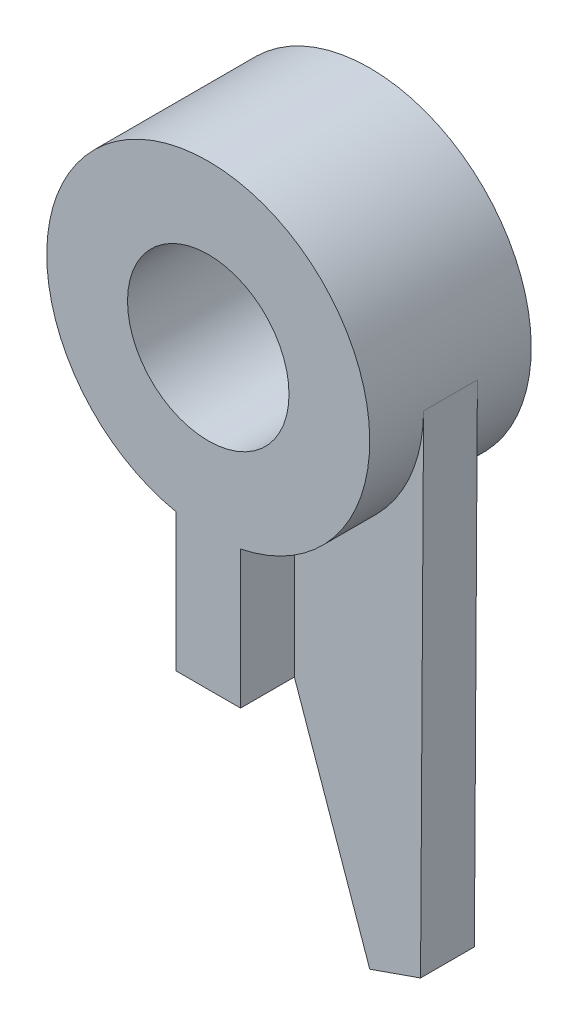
ISO-10303-21;
HEADER;
FILE_DESCRIPTION(('STEP AP214'),'2;1');
FILE_NAME('part.step','',(''),(''),'','','');
FILE_SCHEMA(('AUTOMOTIVE_DESIGN { 1 0 10303 214 1 1 1 1 }'));
ENDSEC;
DATA;
#1=APPLICATION_CONTEXT('core data for automotive mechanical design processes');
#2=APPLICATION_PROTOCOL_DEFINITION('international standard','automotive_design',2000,#1);
#3=PRODUCT_CONTEXT('',#1,'mechanical');
#4=PRODUCT('Part','Part','',(#3));
#5=PRODUCT_RELATED_PRODUCT_CATEGORY('part','',(#4));
#6=PRODUCT_DEFINITION_FORMATION('','',#4);
#7=PRODUCT_DEFINITION_CONTEXT('part definition',#1,'design');
#8=PRODUCT_DEFINITION('design','',#6,#7);
#9=PRODUCT_DEFINITION_SHAPE('','',#8);
#10=(LENGTH_UNIT() NAMED_UNIT(*) SI_UNIT(.MILLI.,.METRE.));
#11=(NAMED_UNIT(*) PLANE_ANGLE_UNIT() SI_UNIT($,.RADIAN.));
#12=(NAMED_UNIT(*) SI_UNIT($,.STERADIAN.) SOLID_ANGLE_UNIT());
#13=UNCERTAINTY_MEASURE_WITH_UNIT(LENGTH_MEASURE(1.E-05),#10,'distance_accuracy_value','');
#14=(GEOMETRIC_REPRESENTATION_CONTEXT(3) GLOBAL_UNCERTAINTY_ASSIGNED_CONTEXT((#13)) GLOBAL_UNIT_ASSIGNED_CONTEXT((#10,
#11,#12)) REPRESENTATION_CONTEXT('',''));
#15=CARTESIAN_POINT('',(0.,0.,0.));
#16=DIRECTION('',(0.,0.,1.));
#17=DIRECTION('',(1.,0.,0.));
#18=AXIS2_PLACEMENT_3D('',#15,#16,#17);
#19=CARTESIAN_POINT('',(6.00000000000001,-55.,15.));
#20=DIRECTION('',(-1.,0.,0.));
#21=DIRECTION('',(0.,0.,1.));
#22=AXIS2_PLACEMENT_3D('',#19,#20,#21);
#23=PLANE('',#22);
#24=DIRECTION('',(0.,-1.,0.));
#25=VECTOR('',#24,1.);
#26=CARTESIAN_POINT('',(6.00000000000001,-55.,-5.));
#27=LINE('',#26,#25);
#28=CARTESIAN_POINT('',(6.00000000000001,-29.3938769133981,-5.));
#29=VERTEX_POINT('',#28);
#30=CARTESIAN_POINT('',(6.00000000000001,-55.,-5.));
#31=VERTEX_POINT('',#30);
#32=EDGE_CURVE('E112',#29,#31,#27,.T.);
#33=ORIENTED_EDGE('',*,*,#32,.T.);
#34=DIRECTION('',(0.,0.,-1.));
#35=VECTOR('',#34,1.);
#36=CARTESIAN_POINT('',(6.00000000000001,-55.,15.));
#37=LINE('',#36,#35);
#38=CARTESIAN_POINT('',(6.00000000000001,-55.,-15.));
#39=VERTEX_POINT('',#38);
#40=EDGE_CURVE('E179',#31,#39,#37,.T.);
#41=ORIENTED_EDGE('',*,*,#40,.T.);
#42=DIRECTION('',(0.,1.,0.));
#43=VECTOR('',#42,1.);
#44=CARTESIAN_POINT('',(6.00000000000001,-55.,-15.));
#45=LINE('',#44,#43);
#46=CARTESIAN_POINT('',(6.00000000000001,-29.3938769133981,-15.));
#47=VERTEX_POINT('',#46);
#48=EDGE_CURVE('E115',#39,#47,#45,.T.);
#49=ORIENTED_EDGE('',*,*,#48,.T.);
#50=DIRECTION('',(0.,0.,-1.));
#51=VECTOR('',#50,1.);
#52=CARTESIAN_POINT('',(6.00000000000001,-29.3938769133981,15.));
#53=LINE('',#52,#51);
#54=EDGE_CURVE('E110',#29,#47,#53,.T.);
#55=ORIENTED_EDGE('',*,*,#54,.F.);
#56=EDGE_LOOP('',(#33,#41,#49,#55));
#57=FACE_BOUND('',#56,.T.);
#58=ADVANCED_FACE('F39',(#57),#23,.F.);
#59=CARTESIAN_POINT('',(0.,0.,15.));
#60=DIRECTION('',(0.,0.,1.));
#61=DIRECTION('',(1.,0.,0.));
#62=AXIS2_PLACEMENT_3D('',#59,#60,#61);
#63=PLANE('',#62);
#64=CARTESIAN_POINT('',(0.,0.,15.));
#65=DIRECTION('',(0.,0.,1.));
#66=DIRECTION('',(1.,0.,0.));
#67=AXIS2_PLACEMENT_3D('',#64,#65,#66);
#68=CIRCLE('',#67,30.);
#69=CARTESIAN_POINT('',(6.00000000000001,-29.3938769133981,15.));
#70=VERTEX_POINT('',#69);
#71=CARTESIAN_POINT('',(-6.,-29.3938769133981,15.));
#72=VERTEX_POINT('',#71);
#73=EDGE_CURVE('E171',#70,#72,#68,.T.);
#74=ORIENTED_EDGE('',*,*,#73,.T.);
#75=DIRECTION('',(0.,-1.,0.));
#76=VECTOR('',#75,1.);
#77=CARTESIAN_POINT('',(-6.,-29.3938769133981,15.));
#78=LINE('',#77,#76);
#79=CARTESIAN_POINT('',(-5.99999999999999,-55.,15.));
#80=VERTEX_POINT('',#79);
#81=EDGE_CURVE('E174',#72,#80,#78,.T.);
#82=ORIENTED_EDGE('',*,*,#81,.T.);
#83=DIRECTION('',(1.,0.,0.));
#84=VECTOR('',#83,1.);
#85=CARTESIAN_POINT('',(-5.99999999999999,-55.,15.));
#86=LINE('',#85,#84);
#87=CARTESIAN_POINT('',(6.00000000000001,-55.,15.));
#88=VERTEX_POINT('',#87);
#89=EDGE_CURVE('E176',#80,#88,#86,.T.);
#90=ORIENTED_EDGE('',*,*,#89,.T.);
#91=DIRECTION('',(0.,1.,0.));
#92=VECTOR('',#91,1.);
#93=CARTESIAN_POINT('',(6.00000000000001,-55.,15.));
#94=LINE('',#93,#92);
#95=EDGE_CURVE('E119',#88,#70,#94,.T.);
#96=ORIENTED_EDGE('',*,*,#95,.T.);
#97=EDGE_LOOP('',(#74,#82,#90,#96));
#98=FACE_BOUND('',#97,.T.);
#99=CARTESIAN_POINT('',(0.,0.,15.));
#100=DIRECTION('',(0.,0.,1.));
#101=DIRECTION('',(1.,0.,0.));
#102=AXIS2_PLACEMENT_3D('',#99,#100,#101);
#103=CIRCLE('',#102,15.);
#104=CARTESIAN_POINT('',(15.,0.,15.));
#105=VERTEX_POINT('',#104);
#106=EDGE_CURVE('E160',#105,#105,#103,.T.);
#107=ORIENTED_EDGE('',*,*,#106,.F.);
#108=EDGE_LOOP('',(#107));
#109=FACE_BOUND('',#108,.T.);
#110=ADVANCED_FACE('F197',(#98,#109),#63,.T.);
#111=CARTESIAN_POINT('',(0.,0.,-15.));
#112=DIRECTION('',(0.,0.,1.));
#113=DIRECTION('',(1.,0.,0.));
#114=AXIS2_PLACEMENT_3D('',#111,#112,#113);
#115=PLANE('',#114);
#116=CARTESIAN_POINT('',(0.,0.,-15.));
#117=DIRECTION('',(0.,0.,1.));
#118=DIRECTION('',(1.,0.,0.));
#119=AXIS2_PLACEMENT_3D('',#116,#117,#118);
#120=CIRCLE('',#119,30.);
#121=CARTESIAN_POINT('',(-6.,-29.3938769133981,-15.));
#122=VERTEX_POINT('',#121);
#123=EDGE_CURVE('E163',#47,#122,#120,.T.);
#124=ORIENTED_EDGE('',*,*,#123,.F.);
#125=ORIENTED_EDGE('',*,*,#48,.F.);
#126=DIRECTION('',(1.,0.,0.));
#127=VECTOR('',#126,1.);
#128=CARTESIAN_POINT('',(-5.99999999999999,-55.,-15.));
#129=LINE('',#128,#127);
#130=CARTESIAN_POINT('',(-5.99999999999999,-55.,-15.));
#131=VERTEX_POINT('',#130);
#132=EDGE_CURVE('E167',#131,#39,#129,.T.);
#133=ORIENTED_EDGE('',*,*,#132,.F.);
#134=DIRECTION('',(0.,-1.,0.));
#135=VECTOR('',#134,1.);
#136=CARTESIAN_POINT('',(-6.,-29.3938769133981,-15.));
#137=LINE('',#136,#135);
#138=EDGE_CURVE('E165',#122,#131,#137,.T.);
#139=ORIENTED_EDGE('',*,*,#138,.F.);
#140=EDGE_LOOP('',(#124,#125,#133,#139));
#141=FACE_BOUND('',#140,.T.);
#142=CARTESIAN_POINT('',(0.,0.,-15.));
#143=DIRECTION('',(0.,0.,1.));
#144=DIRECTION('',(1.,0.,0.));
#145=AXIS2_PLACEMENT_3D('',#142,#143,#144);
#146=CIRCLE('',#145,15.);
#147=CARTESIAN_POINT('',(15.,0.,-15.));
#148=VERTEX_POINT('',#147);
#149=EDGE_CURVE('E157',#148,#148,#146,.T.);
#150=ORIENTED_EDGE('',*,*,#149,.T.);
#151=EDGE_LOOP('',(#150));
#152=FACE_BOUND('',#151,.T.);
#153=ADVANCED_FACE('F191',(#141,#152),#115,.F.);
#154=CARTESIAN_POINT('',(0.,0.,15.));
#155=DIRECTION('',(0.,0.,-1.));
#156=DIRECTION('',(-1.,0.,0.));
#157=AXIS2_PLACEMENT_3D('',#154,#155,#156);
#158=CYLINDRICAL_SURFACE('',#157,30.);
#159=CARTESIAN_POINT('',(6.00000000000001,-29.3938769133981,5.));
#160=VERTEX_POINT('',#159);
#161=EDGE_CURVE('E118',#70,#160,#53,.T.);
#162=ORIENTED_EDGE('',*,*,#161,.T.);
#163=CARTESIAN_POINT('',(0.,0.,5.));
#164=DIRECTION('',(0.,0.,-1.));
#165=DIRECTION('',(1.,0.,0.));
#166=AXIS2_PLACEMENT_3D('',#163,#164,#165);
#167=CIRCLE('',#166,30.);
#168=CARTESIAN_POINT('',(29.9994366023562,-0.183857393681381,5.));
#169=VERTEX_POINT('',#168);
#170=EDGE_CURVE('E54',#169,#160,#167,.T.);
#171=ORIENTED_EDGE('',*,*,#170,.F.);
#172=DIRECTION('',(0.,0.,-1.));
#173=VECTOR('',#172,1.);
#174=CARTESIAN_POINT('',(29.9994366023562,-0.183857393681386,5.));
#175=LINE('',#174,#173);
#176=CARTESIAN_POINT('',(29.9994366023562,-0.183857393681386,-5.));
#177=VERTEX_POINT('',#176);
#178=EDGE_CURVE('E59',#169,#177,#175,.T.);
#179=ORIENTED_EDGE('',*,*,#178,.T.);
#180=CARTESIAN_POINT('',(0.,0.,-5.));
#181=DIRECTION('',(0.,0.,-1.));
#182=DIRECTION('',(1.,0.,0.));
#183=AXIS2_PLACEMENT_3D('',#180,#181,#182);
#184=CIRCLE('',#183,30.);
#185=EDGE_CURVE('E122',#177,#29,#184,.T.);
#186=ORIENTED_EDGE('',*,*,#185,.T.);
#187=ORIENTED_EDGE('',*,*,#54,.T.);
#188=ORIENTED_EDGE('',*,*,#123,.T.);
#189=DIRECTION('',(0.,0.,-1.));
#190=VECTOR('',#189,1.);
#191=CARTESIAN_POINT('',(-6.,-29.3938769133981,15.));
#192=LINE('',#191,#190);
#193=EDGE_CURVE('E11',#72,#122,#192,.T.);
#194=ORIENTED_EDGE('',*,*,#193,.F.);
#195=ORIENTED_EDGE('',*,*,#73,.F.);
#196=EDGE_LOOP('',(#162,#171,#179,#186,#187,#188,#194,#195));
#197=FACE_BOUND('',#196,.T.);
#198=ADVANCED_FACE('F41',(#197),#158,.T.);
#199=CARTESIAN_POINT('',(-6.,-29.3938769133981,15.));
#200=DIRECTION('',(1.,0.,0.));
#201=DIRECTION('',(0.,1.,0.));
#202=AXIS2_PLACEMENT_3D('',#199,#200,#201);
#203=PLANE('',#202);
#204=ORIENTED_EDGE('',*,*,#138,.T.);
#205=DIRECTION('',(0.,0.,-1.));
#206=VECTOR('',#205,1.);
#207=CARTESIAN_POINT('',(-5.99999999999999,-55.,15.));
#208=LINE('',#207,#206);
#209=EDGE_CURVE('E47',#80,#131,#208,.T.);
#210=ORIENTED_EDGE('',*,*,#209,.F.);
#211=ORIENTED_EDGE('',*,*,#81,.F.);
#212=ORIENTED_EDGE('',*,*,#193,.T.);
#213=EDGE_LOOP('',(#204,#210,#211,#212));
#214=FACE_BOUND('',#213,.T.);
#215=ADVANCED_FACE('F195',(#214),#203,.F.);
#216=CARTESIAN_POINT('',(-5.99999999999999,-55.,15.));
#217=DIRECTION('',(0.,1.,0.));
#218=DIRECTION('',(0.,0.,1.));
#219=AXIS2_PLACEMENT_3D('',#216,#217,#218);
#220=PLANE('',#219);
#221=ORIENTED_EDGE('',*,*,#132,.T.);
#222=ORIENTED_EDGE('',*,*,#40,.F.);
#223=DIRECTION('',(0.,0.,-1.));
#224=VECTOR('',#223,1.);
#225=CARTESIAN_POINT('',(6.00000000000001,-55.,5.));
#226=LINE('',#225,#224);
#227=CARTESIAN_POINT('',(6.00000000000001,-55.,5.));
#228=VERTEX_POINT('',#227);
#229=EDGE_CURVE('E154',#228,#31,#226,.T.);
#230=ORIENTED_EDGE('',*,*,#229,.F.);
#231=EDGE_CURVE('E180',#88,#228,#37,.T.);
#232=ORIENTED_EDGE('',*,*,#231,.F.);
#233=ORIENTED_EDGE('',*,*,#89,.F.);
#234=ORIENTED_EDGE('',*,*,#209,.T.);
#235=EDGE_LOOP('',(#221,#222,#230,#232,#233,#234));
#236=FACE_BOUND('',#235,.T.);
#237=ADVANCED_FACE('F187',(#236),#220,.F.);
#238=ORIENTED_EDGE('',*,*,#231,.T.);
#239=DIRECTION('',(0.,-1.,0.));
#240=VECTOR('',#239,1.);
#241=CARTESIAN_POINT('',(6.00000000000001,-55.,5.));
#242=LINE('',#241,#240);
#243=EDGE_CURVE('E138',#160,#228,#242,.T.);
#244=ORIENTED_EDGE('',*,*,#243,.F.);
#245=ORIENTED_EDGE('',*,*,#161,.F.);
#246=ORIENTED_EDGE('',*,*,#95,.F.);
#247=EDGE_LOOP('',(#238,#244,#245,#246));
#248=FACE_BOUND('',#247,.T.);
#249=ADVANCED_FACE('F202',(#248),#23,.F.);
#250=CARTESIAN_POINT('',(0.,0.,15.));
#251=DIRECTION('',(0.,0.,-1.));
#252=DIRECTION('',(-1.,0.,0.));
#253=AXIS2_PLACEMENT_3D('',#250,#251,#252);
#254=CYLINDRICAL_SURFACE('',#253,15.);
#255=ORIENTED_EDGE('',*,*,#106,.T.);
#256=EDGE_LOOP('',(#255));
#257=FACE_BOUND('',#256,.T.);
#258=ORIENTED_EDGE('',*,*,#149,.F.);
#259=EDGE_LOOP('',(#258));
#260=FACE_BOUND('',#259,.T.);
#261=ADVANCED_FACE('F217',(#257,#260),#254,.F.);
#262=CARTESIAN_POINT('',(6.00000000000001,-55.,5.));
#263=DIRECTION('',(0.943858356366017,0.330350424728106,0.));
#264=DIRECTION('',(-0.330350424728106,0.943858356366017,0.));
#265=AXIS2_PLACEMENT_3D('',#262,#263,#264);
#266=PLANE('',#265);
#267=DIRECTION('',(0.330350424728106,-0.943858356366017,0.));
#268=VECTOR('',#267,1.);
#269=CARTESIAN_POINT('',(6.00000000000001,-55.,-5.));
#270=LINE('',#269,#268);
#271=CARTESIAN_POINT('',(20.,-95.,-5.));
#272=VERTEX_POINT('',#271);
#273=EDGE_CURVE('E129',#31,#272,#270,.T.);
#274=ORIENTED_EDGE('',*,*,#273,.T.);
#275=DIRECTION('',(0.,0.,-1.));
#276=VECTOR('',#275,1.);
#277=CARTESIAN_POINT('',(20.,-95.,5.));
#278=LINE('',#277,#276);
#279=CARTESIAN_POINT('',(20.,-95.,5.));
#280=VERTEX_POINT('',#279);
#281=EDGE_CURVE('E151',#280,#272,#278,.T.);
#282=ORIENTED_EDGE('',*,*,#281,.F.);
#283=DIRECTION('',(0.330350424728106,-0.943858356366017,0.));
#284=VECTOR('',#283,1.);
#285=CARTESIAN_POINT('',(6.00000000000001,-55.,5.));
#286=LINE('',#285,#284);
#287=EDGE_CURVE('E141',#228,#280,#286,.T.);
#288=ORIENTED_EDGE('',*,*,#287,.F.);
#289=ORIENTED_EDGE('',*,*,#229,.T.);
#290=EDGE_LOOP('',(#274,#282,#288,#289));
#291=FACE_BOUND('',#290,.T.);
#292=ADVANCED_FACE('F215',(#291),#266,.F.);
#293=CARTESIAN_POINT('',(20.,-95.,5.));
#294=DIRECTION('',(-0.330350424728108,0.943858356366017,0.));
#295=DIRECTION('',(-0.943858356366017,-0.330350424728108,0.));
#296=AXIS2_PLACEMENT_3D('',#293,#294,#295);
#297=PLANE('',#296);
#298=DIRECTION('',(0.943858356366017,0.330350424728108,0.));
#299=VECTOR('',#298,1.);
#300=CARTESIAN_POINT('',(20.,-95.,-5.));
#301=LINE('',#300,#299);
#302=CARTESIAN_POINT('',(29.4385835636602,-91.6964957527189,-5.));
#303=VERTEX_POINT('',#302);
#304=EDGE_CURVE('E131',#272,#303,#301,.T.);
#305=ORIENTED_EDGE('',*,*,#304,.T.);
#306=DIRECTION('',(0.,0.,-1.));
#307=VECTOR('',#306,1.);
#308=CARTESIAN_POINT('',(29.4385835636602,-91.6964957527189,5.));
#309=LINE('',#308,#307);
#310=CARTESIAN_POINT('',(29.4385835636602,-91.6964957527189,5.));
#311=VERTEX_POINT('',#310);
#312=EDGE_CURVE('E148',#311,#303,#309,.T.);
#313=ORIENTED_EDGE('',*,*,#312,.F.);
#314=DIRECTION('',(0.943858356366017,0.330350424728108,0.));
#315=VECTOR('',#314,1.);
#316=CARTESIAN_POINT('',(20.,-95.,5.));
#317=LINE('',#316,#315);
#318=EDGE_CURVE('E143',#280,#311,#317,.T.);
#319=ORIENTED_EDGE('',*,*,#318,.F.);
#320=ORIENTED_EDGE('',*,*,#281,.T.);
#321=EDGE_LOOP('',(#305,#313,#319,#320));
#322=FACE_BOUND('',#321,.T.);
#323=ADVANCED_FACE('F212',(#322),#297,.F.);
#324=CARTESIAN_POINT('',(29.4385835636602,-91.6964957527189,5.));
#325=DIRECTION('',(-0.99998122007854,0.00612857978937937,0.));
#326=DIRECTION('',(-0.00612857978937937,-0.99998122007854,0.));
#327=AXIS2_PLACEMENT_3D('',#324,#325,#326);
#328=PLANE('',#327);
#329=DIRECTION('',(0.00612857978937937,0.99998122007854,0.));
#330=VECTOR('',#329,1.);
#331=CARTESIAN_POINT('',(29.4385835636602,-91.6964957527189,-5.));
#332=LINE('',#331,#330);
#333=EDGE_CURVE('E135',#303,#177,#332,.T.);
#334=ORIENTED_EDGE('',*,*,#333,.T.);
#335=ORIENTED_EDGE('',*,*,#178,.F.);
#336=DIRECTION('',(0.00612857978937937,0.99998122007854,0.));
#337=VECTOR('',#336,1.);
#338=CARTESIAN_POINT('',(29.4385835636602,-91.6964957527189,5.));
#339=LINE('',#338,#337);
#340=EDGE_CURVE('E145',#311,#169,#339,.T.);
#341=ORIENTED_EDGE('',*,*,#340,.F.);
#342=ORIENTED_EDGE('',*,*,#312,.T.);
#343=EDGE_LOOP('',(#334,#335,#341,#342));
#344=FACE_BOUND('',#343,.T.);
#345=ADVANCED_FACE('F210',(#344),#328,.F.);
#346=CARTESIAN_POINT('',(0.,0.,5.));
#347=DIRECTION('',(0.,0.,1.));
#348=DIRECTION('',(1.,0.,0.));
#349=AXIS2_PLACEMENT_3D('',#346,#347,#348);
#350=PLANE('',#349);
#351=ORIENTED_EDGE('',*,*,#170,.T.);
#352=ORIENTED_EDGE('',*,*,#243,.T.);
#353=ORIENTED_EDGE('',*,*,#287,.T.);
#354=ORIENTED_EDGE('',*,*,#318,.T.);
#355=ORIENTED_EDGE('',*,*,#340,.T.);
#356=EDGE_LOOP('',(#351,#352,#353,#354,#355));
#357=FACE_BOUND('',#356,.T.);
#358=ADVANCED_FACE('F204',(#357),#350,.T.);
#359=CARTESIAN_POINT('',(0.,0.,-5.));
#360=DIRECTION('',(0.,0.,1.));
#361=DIRECTION('',(1.,0.,0.));
#362=AXIS2_PLACEMENT_3D('',#359,#360,#361);
#363=PLANE('',#362);
#364=ORIENTED_EDGE('',*,*,#185,.F.);
#365=ORIENTED_EDGE('',*,*,#333,.F.);
#366=ORIENTED_EDGE('',*,*,#304,.F.);
#367=ORIENTED_EDGE('',*,*,#273,.F.);
#368=ORIENTED_EDGE('',*,*,#32,.F.);
#369=EDGE_LOOP('',(#364,#365,#366,#367,#368));
#370=FACE_BOUND('',#369,.T.);
#371=ADVANCED_FACE('F127',(#370),#363,.F.);
#372=CLOSED_SHELL('',(#58,#110,#153,#198,#215,#237,#249,#261,#292,#323,#345,#358,#371));
#373=MANIFOLD_SOLID_BREP('B2',#372);
#374=ADVANCED_BREP_SHAPE_REPRESENTATION('',(#18,#373),#14);
#375=SHAPE_DEFINITION_REPRESENTATION(#9,#374);
ENDSEC;
END-ISO-10303-21;
